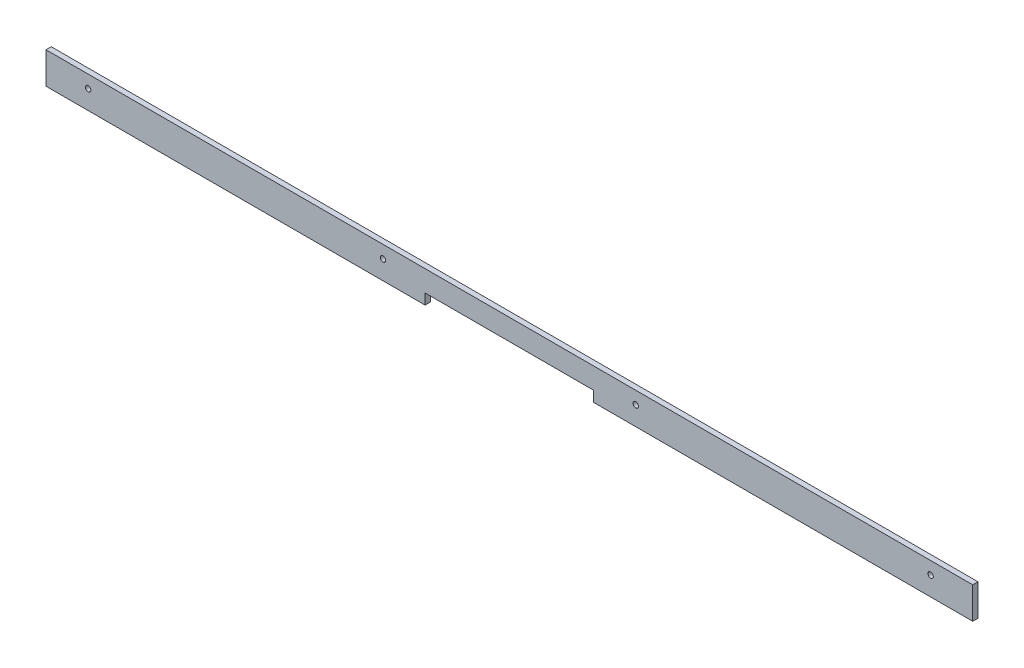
ISO-10303-21;
HEADER;
FILE_DESCRIPTION(('STEP AP214'),'2;1');
FILE_NAME('part.step','',(''),(''),'','','');
FILE_SCHEMA(('AUTOMOTIVE_DESIGN { 1 0 10303 214 1 1 1 1 }'));
ENDSEC;
DATA;
#1=APPLICATION_CONTEXT('core data for automotive mechanical design processes');
#2=APPLICATION_PROTOCOL_DEFINITION('international standard','automotive_design',2000,#1);
#3=PRODUCT_CONTEXT('',#1,'mechanical');
#4=PRODUCT('Part','Part','',(#3));
#5=PRODUCT_RELATED_PRODUCT_CATEGORY('part','',(#4));
#6=PRODUCT_DEFINITION_FORMATION('','',#4);
#7=PRODUCT_DEFINITION_CONTEXT('part definition',#1,'design');
#8=PRODUCT_DEFINITION('design','',#6,#7);
#9=PRODUCT_DEFINITION_SHAPE('','',#8);
#10=(LENGTH_UNIT() NAMED_UNIT(*) SI_UNIT(.MILLI.,.METRE.));
#11=(NAMED_UNIT(*) PLANE_ANGLE_UNIT() SI_UNIT($,.RADIAN.));
#12=(NAMED_UNIT(*) SI_UNIT($,.STERADIAN.) SOLID_ANGLE_UNIT());
#13=UNCERTAINTY_MEASURE_WITH_UNIT(LENGTH_MEASURE(1.E-05),#10,'distance_accuracy_value','');
#14=(GEOMETRIC_REPRESENTATION_CONTEXT(3) GLOBAL_UNCERTAINTY_ASSIGNED_CONTEXT((#13)) GLOBAL_UNIT_ASSIGNED_CONTEXT((#10,
#11,#12)) REPRESENTATION_CONTEXT('',''));
#15=CARTESIAN_POINT('',(0.,0.,0.));
#16=DIRECTION('',(0.,0.,1.));
#17=DIRECTION('',(1.,0.,0.));
#18=AXIS2_PLACEMENT_3D('',#15,#16,#17);
#19=CARTESIAN_POINT('',(-279.4,-9.52500000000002,3.175));
#20=DIRECTION('',(0.,1.,0.));
#21=DIRECTION('',(0.,0.,1.));
#22=AXIS2_PLACEMENT_3D('',#19,#20,#21);
#23=PLANE('',#22);
#24=DIRECTION('',(1.,0.,0.));
#25=VECTOR('',#24,1.);
#26=CARTESIAN_POINT('',(-279.4,-9.52500000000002,0.));
#27=LINE('',#26,#25);
#28=CARTESIAN_POINT('',(-279.4,-9.52500000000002,0.));
#29=VERTEX_POINT('',#28);
#30=CARTESIAN_POINT('',(-50.8,-9.52500000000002,0.));
#31=VERTEX_POINT('',#30);
#32=EDGE_CURVE('E121',#29,#31,#27,.T.);
#33=ORIENTED_EDGE('',*,*,#32,.T.);
#34=DIRECTION('',(0.,0.,1.));
#35=VECTOR('',#34,1.);
#36=CARTESIAN_POINT('',(-50.8,-9.52500000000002,0.));
#37=LINE('',#36,#35);
#38=CARTESIAN_POINT('',(-50.8,-9.52500000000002,3.175));
#39=VERTEX_POINT('',#38);
#40=EDGE_CURVE('E109',#31,#39,#37,.T.);
#41=ORIENTED_EDGE('',*,*,#40,.T.);
#42=DIRECTION('',(1.,0.,0.));
#43=VECTOR('',#42,1.);
#44=CARTESIAN_POINT('',(-279.4,-9.52500000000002,3.175));
#45=LINE('',#44,#43);
#46=CARTESIAN_POINT('',(-279.4,-9.52500000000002,3.175));
#47=VERTEX_POINT('',#46);
#48=EDGE_CURVE('E87',#47,#39,#45,.T.);
#49=ORIENTED_EDGE('',*,*,#48,.F.);
#50=DIRECTION('',(0.,0.,-1.));
#51=VECTOR('',#50,1.);
#52=CARTESIAN_POINT('',(-279.4,-9.52500000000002,3.175));
#53=LINE('',#52,#51);
#54=EDGE_CURVE('E11',#47,#29,#53,.T.);
#55=ORIENTED_EDGE('',*,*,#54,.T.);
#56=EDGE_LOOP('',(#33,#41,#49,#55));
#57=FACE_BOUND('',#56,.T.);
#58=ADVANCED_FACE('F35',(#57),#23,.F.);
#59=CARTESIAN_POINT('',(-279.4,9.52499999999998,3.175));
#60=DIRECTION('',(1.,0.,0.));
#61=DIRECTION('',(0.,0.,-1.));
#62=AXIS2_PLACEMENT_3D('',#59,#60,#61);
#63=PLANE('',#62);
#64=DIRECTION('',(0.,-1.,0.));
#65=VECTOR('',#64,1.);
#66=CARTESIAN_POINT('',(-279.4,9.52499999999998,0.));
#67=LINE('',#66,#65);
#68=CARTESIAN_POINT('',(-279.4,9.52499999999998,0.));
#69=VERTEX_POINT('',#68);
#70=EDGE_CURVE('E132',#69,#29,#67,.T.);
#71=ORIENTED_EDGE('',*,*,#70,.T.);
#72=ORIENTED_EDGE('',*,*,#54,.F.);
#73=DIRECTION('',(0.,-1.,0.));
#74=VECTOR('',#73,1.);
#75=CARTESIAN_POINT('',(-279.4,9.52499999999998,3.175));
#76=LINE('',#75,#74);
#77=CARTESIAN_POINT('',(-279.4,9.52499999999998,3.175));
#78=VERTEX_POINT('',#77);
#79=EDGE_CURVE('E137',#78,#47,#76,.T.);
#80=ORIENTED_EDGE('',*,*,#79,.F.);
#81=DIRECTION('',(0.,0.,-1.));
#82=VECTOR('',#81,1.);
#83=CARTESIAN_POINT('',(-279.4,9.52499999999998,3.175));
#84=LINE('',#83,#82);
#85=EDGE_CURVE('E138',#78,#69,#84,.T.);
#86=ORIENTED_EDGE('',*,*,#85,.T.);
#87=EDGE_LOOP('',(#71,#72,#80,#86));
#88=FACE_BOUND('',#87,.T.);
#89=ADVANCED_FACE('F37',(#88),#63,.F.);
#90=CARTESIAN_POINT('',(50.8,-9.525,3.175));
#91=VERTEX_POINT('',#90);
#92=CARTESIAN_POINT('',(279.4,-9.52500000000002,3.175));
#93=VERTEX_POINT('',#92);
#94=EDGE_CURVE('E163',#91,#93,#45,.T.);
#95=ORIENTED_EDGE('',*,*,#94,.F.);
#96=DIRECTION('',(0.,0.,1.));
#97=VECTOR('',#96,1.);
#98=CARTESIAN_POINT('',(50.8,-9.525,0.));
#99=LINE('',#98,#97);
#100=CARTESIAN_POINT('',(50.8,-9.525,0.));
#101=VERTEX_POINT('',#100);
#102=EDGE_CURVE('E116',#101,#91,#99,.T.);
#103=ORIENTED_EDGE('',*,*,#102,.F.);
#104=CARTESIAN_POINT('',(279.4,-9.52500000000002,0.));
#105=VERTEX_POINT('',#104);
#106=EDGE_CURVE('E129',#101,#105,#27,.T.);
#107=ORIENTED_EDGE('',*,*,#106,.T.);
#108=DIRECTION('',(0.,0.,-1.));
#109=VECTOR('',#108,1.);
#110=CARTESIAN_POINT('',(279.4,-9.52500000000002,3.175));
#111=LINE('',#110,#109);
#112=EDGE_CURVE('E43',#93,#105,#111,.T.);
#113=ORIENTED_EDGE('',*,*,#112,.F.);
#114=EDGE_LOOP('',(#95,#103,#107,#113));
#115=FACE_BOUND('',#114,.T.);
#116=ADVANCED_FACE('F231',(#115),#23,.F.);
#117=CARTESIAN_POINT('',(279.4,9.52499999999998,3.175));
#118=DIRECTION('',(-1.,0.,0.));
#119=DIRECTION('',(0.,0.,1.));
#120=AXIS2_PLACEMENT_3D('',#117,#118,#119);
#121=PLANE('',#120);
#122=DIRECTION('',(0.,1.,0.));
#123=VECTOR('',#122,1.);
#124=CARTESIAN_POINT('',(279.4,9.52499999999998,0.));
#125=LINE('',#124,#123);
#126=CARTESIAN_POINT('',(279.4,9.52499999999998,0.));
#127=VERTEX_POINT('',#126);
#128=EDGE_CURVE('E128',#105,#127,#125,.T.);
#129=ORIENTED_EDGE('',*,*,#128,.T.);
#130=DIRECTION('',(0.,0.,-1.));
#131=VECTOR('',#130,1.);
#132=CARTESIAN_POINT('',(279.4,9.52499999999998,3.175));
#133=LINE('',#132,#131);
#134=CARTESIAN_POINT('',(279.4,9.52499999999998,3.175));
#135=VERTEX_POINT('',#134);
#136=EDGE_CURVE('E140',#135,#127,#133,.T.);
#137=ORIENTED_EDGE('',*,*,#136,.F.);
#138=DIRECTION('',(0.,1.,0.));
#139=VECTOR('',#138,1.);
#140=CARTESIAN_POINT('',(279.4,9.52499999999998,3.175));
#141=LINE('',#140,#139);
#142=EDGE_CURVE('E148',#93,#135,#141,.T.);
#143=ORIENTED_EDGE('',*,*,#142,.F.);
#144=ORIENTED_EDGE('',*,*,#112,.T.);
#145=EDGE_LOOP('',(#129,#137,#143,#144));
#146=FACE_BOUND('',#145,.T.);
#147=ADVANCED_FACE('F146',(#146),#121,.F.);
#148=CARTESIAN_POINT('',(-279.4,9.52499999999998,3.175));
#149=DIRECTION('',(0.,-1.,0.));
#150=DIRECTION('',(0.,0.,-1.));
#151=AXIS2_PLACEMENT_3D('',#148,#149,#150);
#152=PLANE('',#151);
#153=DIRECTION('',(-1.,0.,0.));
#154=VECTOR('',#153,1.);
#155=CARTESIAN_POINT('',(-279.4,9.52499999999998,0.));
#156=LINE('',#155,#154);
#157=EDGE_CURVE('E80',#127,#69,#156,.T.);
#158=ORIENTED_EDGE('',*,*,#157,.T.);
#159=ORIENTED_EDGE('',*,*,#85,.F.);
#160=DIRECTION('',(-1.,0.,0.));
#161=VECTOR('',#160,1.);
#162=CARTESIAN_POINT('',(-279.4,9.52499999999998,3.175));
#163=LINE('',#162,#161);
#164=EDGE_CURVE('E59',#135,#78,#163,.T.);
#165=ORIENTED_EDGE('',*,*,#164,.F.);
#166=ORIENTED_EDGE('',*,*,#136,.T.);
#167=EDGE_LOOP('',(#158,#159,#165,#166));
#168=FACE_BOUND('',#167,.T.);
#169=ADVANCED_FACE('F167',(#168),#152,.F.);
#170=CARTESIAN_POINT('',(0.,0.,3.175));
#171=DIRECTION('',(0.,0.,1.));
#172=DIRECTION('',(1.,0.,0.));
#173=AXIS2_PLACEMENT_3D('',#170,#171,#172);
#174=PLANE('',#173);
#175=CARTESIAN_POINT('',(-254.,1.90499999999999,3.175));
#176=DIRECTION('',(0.,0.,1.));
#177=DIRECTION('',(1.,0.,0.));
#178=AXIS2_PLACEMENT_3D('',#175,#176,#177);
#179=CIRCLE('',#178,1.63194999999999);
#180=CARTESIAN_POINT('',(-252.36805,1.90499999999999,3.175));
#181=VERTEX_POINT('',#180);
#182=EDGE_CURVE('E197',#181,#181,#179,.T.);
#183=ORIENTED_EDGE('',*,*,#182,.F.);
#184=EDGE_LOOP('',(#183));
#185=FACE_BOUND('',#184,.T.);
#186=CARTESIAN_POINT('',(-76.2,1.90499999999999,3.175));
#187=DIRECTION('',(0.,0.,1.));
#188=DIRECTION('',(1.,0.,0.));
#189=AXIS2_PLACEMENT_3D('',#186,#187,#188);
#190=CIRCLE('',#189,1.63194999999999);
#191=CARTESIAN_POINT('',(-74.56805,1.90499999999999,3.175));
#192=VERTEX_POINT('',#191);
#193=EDGE_CURVE('E191',#192,#192,#190,.T.);
#194=ORIENTED_EDGE('',*,*,#193,.F.);
#195=EDGE_LOOP('',(#194));
#196=FACE_BOUND('',#195,.T.);
#197=CARTESIAN_POINT('',(76.2,1.90499999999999,3.175));
#198=DIRECTION('',(0.,0.,1.));
#199=DIRECTION('',(1.,0.,0.));
#200=AXIS2_PLACEMENT_3D('',#197,#198,#199);
#201=CIRCLE('',#200,1.63194999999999);
#202=CARTESIAN_POINT('',(77.83195,1.90499999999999,3.175));
#203=VERTEX_POINT('',#202);
#204=EDGE_CURVE('E185',#203,#203,#201,.T.);
#205=ORIENTED_EDGE('',*,*,#204,.F.);
#206=EDGE_LOOP('',(#205));
#207=FACE_BOUND('',#206,.T.);
#208=CARTESIAN_POINT('',(254.,1.90499999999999,3.175));
#209=DIRECTION('',(0.,0.,1.));
#210=DIRECTION('',(1.,0.,0.));
#211=AXIS2_PLACEMENT_3D('',#208,#209,#210);
#212=CIRCLE('',#211,1.63194999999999);
#213=CARTESIAN_POINT('',(255.63195,1.90499999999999,3.175));
#214=VERTEX_POINT('',#213);
#215=EDGE_CURVE('E175',#214,#214,#212,.T.);
#216=ORIENTED_EDGE('',*,*,#215,.F.);
#217=EDGE_LOOP('',(#216));
#218=FACE_BOUND('',#217,.T.);
#219=DIRECTION('',(0.,-1.,0.));
#220=VECTOR('',#219,1.);
#221=CARTESIAN_POINT('',(-50.8,-9.52500000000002,3.175));
#222=LINE('',#221,#220);
#223=CARTESIAN_POINT('',(-50.8,-3.17500000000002,3.175));
#224=VERTEX_POINT('',#223);
#225=EDGE_CURVE('E114',#224,#39,#222,.T.);
#226=ORIENTED_EDGE('',*,*,#225,.F.);
#227=DIRECTION('',(-1.,0.,0.));
#228=VECTOR('',#227,1.);
#229=CARTESIAN_POINT('',(-50.8,-3.17500000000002,3.175));
#230=LINE('',#229,#228);
#231=CARTESIAN_POINT('',(50.8,-3.175,3.175));
#232=VERTEX_POINT('',#231);
#233=EDGE_CURVE('E124',#232,#224,#230,.T.);
#234=ORIENTED_EDGE('',*,*,#233,.F.);
#235=DIRECTION('',(0.,1.,0.));
#236=VECTOR('',#235,1.);
#237=CARTESIAN_POINT('',(50.8,-9.525,3.175));
#238=LINE('',#237,#236);
#239=EDGE_CURVE('E170',#91,#232,#238,.T.);
#240=ORIENTED_EDGE('',*,*,#239,.F.);
#241=ORIENTED_EDGE('',*,*,#94,.T.);
#242=ORIENTED_EDGE('',*,*,#142,.T.);
#243=ORIENTED_EDGE('',*,*,#164,.T.);
#244=ORIENTED_EDGE('',*,*,#79,.T.);
#245=ORIENTED_EDGE('',*,*,#48,.T.);
#246=EDGE_LOOP('',(#226,#234,#240,#241,#242,#243,#244,#245));
#247=FACE_BOUND('',#246,.T.);
#248=ADVANCED_FACE('F165',(#185,#196,#207,#218,#247),#174,.T.);
#249=CARTESIAN_POINT('',(0.,0.,0.));
#250=DIRECTION('',(0.,0.,1.));
#251=DIRECTION('',(1.,0.,0.));
#252=AXIS2_PLACEMENT_3D('',#249,#250,#251);
#253=PLANE('',#252);
#254=CARTESIAN_POINT('',(-254.,1.90499999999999,0.));
#255=DIRECTION('',(0.,0.,1.));
#256=DIRECTION('',(1.,0.,0.));
#257=AXIS2_PLACEMENT_3D('',#254,#255,#256);
#258=CIRCLE('',#257,1.63194999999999);
#259=CARTESIAN_POINT('',(-252.36805,1.90499999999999,0.));
#260=VERTEX_POINT('',#259);
#261=EDGE_CURVE('E194',#260,#260,#258,.T.);
#262=ORIENTED_EDGE('',*,*,#261,.T.);
#263=EDGE_LOOP('',(#262));
#264=FACE_BOUND('',#263,.T.);
#265=CARTESIAN_POINT('',(-76.2,1.90499999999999,0.));
#266=DIRECTION('',(0.,0.,1.));
#267=DIRECTION('',(1.,0.,0.));
#268=AXIS2_PLACEMENT_3D('',#265,#266,#267);
#269=CIRCLE('',#268,1.63194999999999);
#270=CARTESIAN_POINT('',(-74.56805,1.90499999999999,0.));
#271=VERTEX_POINT('',#270);
#272=EDGE_CURVE('E188',#271,#271,#269,.T.);
#273=ORIENTED_EDGE('',*,*,#272,.T.);
#274=EDGE_LOOP('',(#273));
#275=FACE_BOUND('',#274,.T.);
#276=CARTESIAN_POINT('',(76.2,1.90499999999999,0.));
#277=DIRECTION('',(0.,0.,1.));
#278=DIRECTION('',(1.,0.,0.));
#279=AXIS2_PLACEMENT_3D('',#276,#277,#278);
#280=CIRCLE('',#279,1.63194999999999);
#281=CARTESIAN_POINT('',(77.83195,1.90499999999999,0.));
#282=VERTEX_POINT('',#281);
#283=EDGE_CURVE('E182',#282,#282,#280,.T.);
#284=ORIENTED_EDGE('',*,*,#283,.T.);
#285=EDGE_LOOP('',(#284));
#286=FACE_BOUND('',#285,.T.);
#287=CARTESIAN_POINT('',(254.,1.90499999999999,0.));
#288=DIRECTION('',(0.,0.,1.));
#289=DIRECTION('',(1.,0.,0.));
#290=AXIS2_PLACEMENT_3D('',#287,#288,#289);
#291=CIRCLE('',#290,1.63194999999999);
#292=CARTESIAN_POINT('',(255.63195,1.90499999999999,0.));
#293=VERTEX_POINT('',#292);
#294=EDGE_CURVE('E171',#293,#293,#291,.T.);
#295=ORIENTED_EDGE('',*,*,#294,.T.);
#296=EDGE_LOOP('',(#295));
#297=FACE_BOUND('',#296,.T.);
#298=DIRECTION('',(-1.,0.,0.));
#299=VECTOR('',#298,1.);
#300=CARTESIAN_POINT('',(-50.8,-3.17500000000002,0.));
#301=LINE('',#300,#299);
#302=CARTESIAN_POINT('',(50.8,-3.175,0.));
#303=VERTEX_POINT('',#302);
#304=CARTESIAN_POINT('',(-50.8,-3.17500000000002,0.));
#305=VERTEX_POINT('',#304);
#306=EDGE_CURVE('E50',#303,#305,#301,.T.);
#307=ORIENTED_EDGE('',*,*,#306,.T.);
#308=DIRECTION('',(0.,-1.,0.));
#309=VECTOR('',#308,1.);
#310=CARTESIAN_POINT('',(-50.8,-9.52500000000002,0.));
#311=LINE('',#310,#309);
#312=EDGE_CURVE('E112',#305,#31,#311,.T.);
#313=ORIENTED_EDGE('',*,*,#312,.T.);
#314=ORIENTED_EDGE('',*,*,#32,.F.);
#315=ORIENTED_EDGE('',*,*,#70,.F.);
#316=ORIENTED_EDGE('',*,*,#157,.F.);
#317=ORIENTED_EDGE('',*,*,#128,.F.);
#318=ORIENTED_EDGE('',*,*,#106,.F.);
#319=DIRECTION('',(0.,1.,0.));
#320=VECTOR('',#319,1.);
#321=CARTESIAN_POINT('',(50.8,-9.525,0.));
#322=LINE('',#321,#320);
#323=EDGE_CURVE('E123',#101,#303,#322,.T.);
#324=ORIENTED_EDGE('',*,*,#323,.T.);
#325=EDGE_LOOP('',(#307,#313,#314,#315,#316,#317,#318,#324));
#326=FACE_BOUND('',#325,.T.);
#327=ADVANCED_FACE('F119',(#264,#275,#286,#297,#326),#253,.F.);
#328=CARTESIAN_POINT('',(-50.8,-9.52500000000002,0.));
#329=DIRECTION('',(-1.,0.,0.));
#330=DIRECTION('',(0.,0.,1.));
#331=AXIS2_PLACEMENT_3D('',#328,#329,#330);
#332=PLANE('',#331);
#333=ORIENTED_EDGE('',*,*,#225,.T.);
#334=ORIENTED_EDGE('',*,*,#40,.F.);
#335=ORIENTED_EDGE('',*,*,#312,.F.);
#336=DIRECTION('',(0.,0.,1.));
#337=VECTOR('',#336,1.);
#338=CARTESIAN_POINT('',(-50.8,-3.17500000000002,0.));
#339=LINE('',#338,#337);
#340=EDGE_CURVE('E153',#305,#224,#339,.T.);
#341=ORIENTED_EDGE('',*,*,#340,.T.);
#342=EDGE_LOOP('',(#333,#334,#335,#341));
#343=FACE_BOUND('',#342,.T.);
#344=ADVANCED_FACE('F111',(#343),#332,.F.);
#345=CARTESIAN_POINT('',(-50.8,-3.17500000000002,0.));
#346=DIRECTION('',(0.,1.,0.));
#347=DIRECTION('',(-1.,0.,0.));
#348=AXIS2_PLACEMENT_3D('',#345,#346,#347);
#349=PLANE('',#348);
#350=ORIENTED_EDGE('',*,*,#233,.T.);
#351=ORIENTED_EDGE('',*,*,#340,.F.);
#352=ORIENTED_EDGE('',*,*,#306,.F.);
#353=DIRECTION('',(0.,0.,1.));
#354=VECTOR('',#353,1.);
#355=CARTESIAN_POINT('',(50.8,-3.175,0.));
#356=LINE('',#355,#354);
#357=EDGE_CURVE('E154',#303,#232,#356,.T.);
#358=ORIENTED_EDGE('',*,*,#357,.T.);
#359=EDGE_LOOP('',(#350,#351,#352,#358));
#360=FACE_BOUND('',#359,.T.);
#361=ADVANCED_FACE('F225',(#360),#349,.F.);
#362=CARTESIAN_POINT('',(50.8,-9.525,0.));
#363=DIRECTION('',(1.,0.,0.));
#364=DIRECTION('',(0.,0.,-1.));
#365=AXIS2_PLACEMENT_3D('',#362,#363,#364);
#366=PLANE('',#365);
#367=ORIENTED_EDGE('',*,*,#239,.T.);
#368=ORIENTED_EDGE('',*,*,#357,.F.);
#369=ORIENTED_EDGE('',*,*,#323,.F.);
#370=ORIENTED_EDGE('',*,*,#102,.T.);
#371=EDGE_LOOP('',(#367,#368,#369,#370));
#372=FACE_BOUND('',#371,.T.);
#373=ADVANCED_FACE('F215',(#372),#366,.F.);
#374=CARTESIAN_POINT('',(254.,1.90499999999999,3.175));
#375=DIRECTION('',(0.,0.,1.));
#376=DIRECTION('',(1.,0.,0.));
#377=AXIS2_PLACEMENT_3D('',#374,#375,#376);
#378=CYLINDRICAL_SURFACE('',#377,1.63194999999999);
#379=ORIENTED_EDGE('',*,*,#294,.F.);
#380=EDGE_LOOP('',(#379));
#381=FACE_BOUND('',#380,.T.);
#382=ORIENTED_EDGE('',*,*,#215,.T.);
#383=EDGE_LOOP('',(#382));
#384=FACE_BOUND('',#383,.T.);
#385=ADVANCED_FACE('F212',(#381,#384),#378,.F.);
#386=CARTESIAN_POINT('',(76.2,1.90499999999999,3.175));
#387=DIRECTION('',(0.,0.,1.));
#388=DIRECTION('',(1.,0.,0.));
#389=AXIS2_PLACEMENT_3D('',#386,#387,#388);
#390=CYLINDRICAL_SURFACE('',#389,1.63194999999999);
#391=ORIENTED_EDGE('',*,*,#283,.F.);
#392=EDGE_LOOP('',(#391));
#393=FACE_BOUND('',#392,.T.);
#394=ORIENTED_EDGE('',*,*,#204,.T.);
#395=EDGE_LOOP('',(#394));
#396=FACE_BOUND('',#395,.T.);
#397=ADVANCED_FACE('F214',(#393,#396),#390,.F.);
#398=CARTESIAN_POINT('',(-76.2,1.90499999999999,3.175));
#399=DIRECTION('',(0.,0.,1.));
#400=DIRECTION('',(1.,0.,0.));
#401=AXIS2_PLACEMENT_3D('',#398,#399,#400);
#402=CYLINDRICAL_SURFACE('',#401,1.63194999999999);
#403=ORIENTED_EDGE('',*,*,#272,.F.);
#404=EDGE_LOOP('',(#403));
#405=FACE_BOUND('',#404,.T.);
#406=ORIENTED_EDGE('',*,*,#193,.T.);
#407=EDGE_LOOP('',(#406));
#408=FACE_BOUND('',#407,.T.);
#409=ADVANCED_FACE('F222',(#405,#408),#402,.F.);
#410=CARTESIAN_POINT('',(-254.,1.90499999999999,3.175));
#411=DIRECTION('',(0.,0.,1.));
#412=DIRECTION('',(1.,0.,0.));
#413=AXIS2_PLACEMENT_3D('',#410,#411,#412);
#414=CYLINDRICAL_SURFACE('',#413,1.63194999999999);
#415=ORIENTED_EDGE('',*,*,#261,.F.);
#416=EDGE_LOOP('',(#415));
#417=FACE_BOUND('',#416,.T.);
#418=ORIENTED_EDGE('',*,*,#182,.T.);
#419=EDGE_LOOP('',(#418));
#420=FACE_BOUND('',#419,.T.);
#421=ADVANCED_FACE('F201',(#417,#420),#414,.F.);
#422=CLOSED_SHELL('',(#58,#89,#116,#147,#169,#248,#327,#344,#361,#373,#385,#397,#409,#421));
#423=MANIFOLD_SOLID_BREP('B2',#422);
#424=ADVANCED_BREP_SHAPE_REPRESENTATION('',(#18,#423),#14);
#425=SHAPE_DEFINITION_REPRESENTATION(#9,#424);
ENDSEC;
END-ISO-10303-21;
